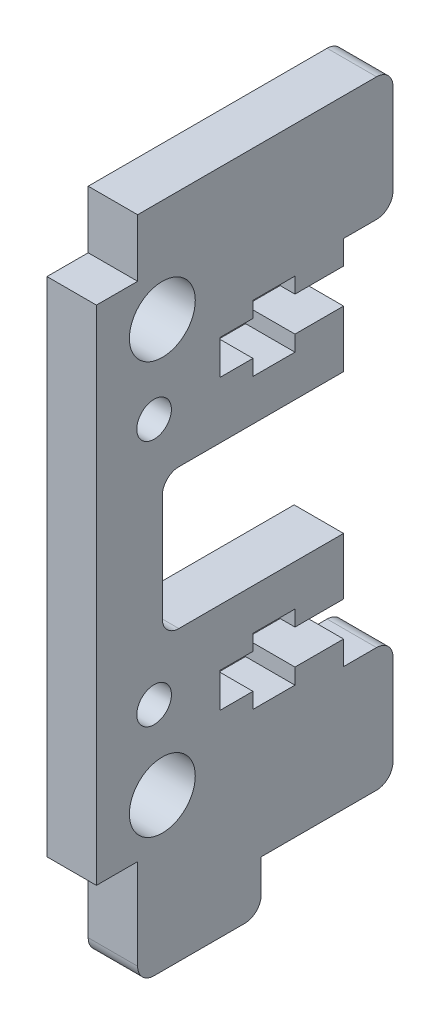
from build123d import *

# Parameters (mm, degrees)
SKETCH_1_R          = 4
SKETCH_1_R_2        = 2.1
EXTRUDE_1_DEPTH     = 6
CUT_EXTRUDE_1_DEPTH = 84.408632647
EXTRUDE_2_DEPTH     = 6


with BuildPart() as part:
    # Sketch 1 → Extrude 1 (new body)
    with BuildSketch(Plane(origin=(0, 0, 0), x_dir=(0, 0, -1), z_dir=(1, 0, 0))):
        with BuildLine():
            Line((5, 0), (34, 0))
            ThreePointArc((34, 0), (35.414213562, 0.585786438), (36, 2))
            Line((36, 2), (36, 13))
            ThreePointArc((36, 13), (35.414213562, 14.414213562), (34, 15))
            Line((34, 15), (30, 15))
            Line((30, 15), (30, 17.9))
            Line((30, 17.9), (24.1, 17.9))
            Line((24.1, 17.9), (24.1, 16))
            Line((24.1, 16), (19, 16))
            Line((19, 16), (19, 17.9))
            Line((19, 17.9), (15, 17.9))
            Line((15, 17.9), (15, 22.1))
            Line((15, 22.1), (19, 22.1))
            Line((19, 22.1), (19, 24))
            Line((19, 24), (24.1, 24))
            Line((24.1, 24), (24.1, 22.1))
            Line((24.1, 22.1), (30, 22.1))
            Line((30, 22.1), (30, 52.9))
            Line((30, 52.9), (24.1, 52.9))
            Line((24.1, 52.9), (24.1, 51))
            Line((24.1, 51), (19, 51))
            Line((19, 51), (19, 52.9))
            Line((19, 52.9), (15, 52.9))
            Line((15, 52.9), (15, 57.1))
            Line((15, 57.1), (19, 57.1))
            Line((19, 57.1), (19, 59))
            Line((19, 59), (24.1, 59))
            Line((24.1, 59), (24.1, 57.1))
            Line((24.1, 57.1), (30, 57.1))
            Line((30, 57.1), (30, 60))
            Line((30, 60), (34, 60))
            ThreePointArc((34, 60), (35.414213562, 60.585786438), (36, 62))
            Line((36, 62), (36, 73))
            ThreePointArc((36, 73), (35.414213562, 74.414213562), (34, 75))
            Line((34, 75), (5, 75))
            Line((5, 75), (5, 68))
            Line((5, 68), (0, 68))
            Line((0, 68), (0, 7))
            Line((0, 7), (5, 7))
            Line((5, 7), (5, 0))
        make_face()
        with Locations((8, 12.5)):
            Circle(SKETCH_1_R, mode=Mode.SUBTRACT)
        with Locations((7, 22.5)):
            Circle(SKETCH_1_R_2, mode=Mode.SUBTRACT)
        with Locations((7, 52.5)):
            Circle(SKETCH_1_R_2, mode=Mode.SUBTRACT)
        with Locations((8, 62.5)):
            Circle(SKETCH_1_R, mode=Mode.SUBTRACT)
    extrude(amount=EXTRUDE_1_DEPTH)

    # Sketch 2 → Cut-Extrude 1 (cut, through all)
    with BuildSketch(Plane(origin=(6, 0, 0), x_dir=(0, 0, -1), z_dir=(1, 0, 0))):
        with BuildLine():
            Line((30, 46), (10, 46))
            ThreePointArc((10, 46), (8.585786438, 45.414213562), (8, 44))
            Line((8, 44), (8, 31))
            ThreePointArc((8, 31), (8.585786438, 29.585786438), (10, 29))
            Line((10, 29), (30, 29))
            Line((30, 29), (30, 46))
        make_face()
    extrude(amount=-CUT_EXTRUDE_1_DEPTH, mode=Mode.SUBTRACT)

    # Sketch 3 → Extrude 2 (add)
    with BuildSketch(Plane(origin=(6, 0, 0), x_dir=(0, 0, -1), z_dir=(1, 0, 0))):
        with BuildLine():
            Line((5, 0), (20, 0))
            Line((20, 0), (20, -4))
            ThreePointArc((20, -4), (19.414213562, -5.414213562), (18, -6))
            Line((18, -6), (7, -6))
            ThreePointArc((7, -6), (5.585786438, -5.414213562), (5, -4))
            Line((5, -4), (5, 0))
        make_face()
    extrude(amount=-EXTRUDE_2_DEPTH)


solid = part.part
